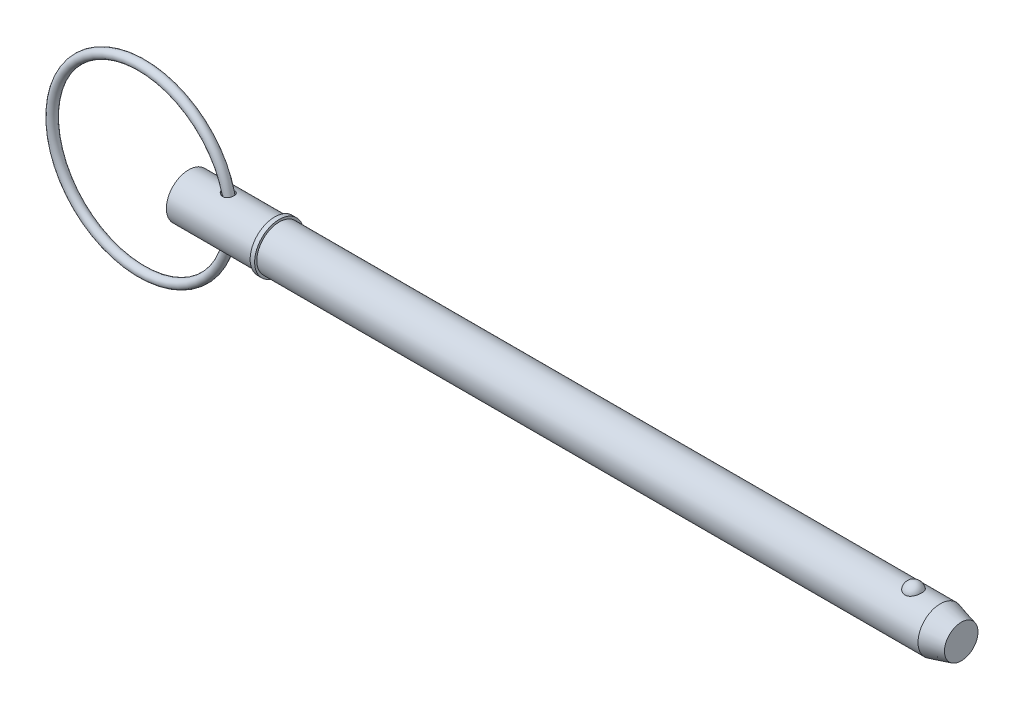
ISO-10303-21;
HEADER;
FILE_DESCRIPTION(('STEP AP214'),'2;1');
FILE_NAME('part.step','',(''),(''),'','','');
FILE_SCHEMA(('AUTOMOTIVE_DESIGN { 1 0 10303 214 1 1 1 1 }'));
ENDSEC;
DATA;
#1=APPLICATION_CONTEXT('core data for automotive mechanical design processes');
#2=APPLICATION_PROTOCOL_DEFINITION('international standard','automotive_design',2000,#1);
#3=PRODUCT_CONTEXT('',#1,'mechanical');
#4=PRODUCT('Part','Part','',(#3));
#5=PRODUCT_RELATED_PRODUCT_CATEGORY('part','',(#4));
#6=PRODUCT_DEFINITION_FORMATION('','',#4);
#7=PRODUCT_DEFINITION_CONTEXT('part definition',#1,'design');
#8=PRODUCT_DEFINITION('design','',#6,#7);
#9=PRODUCT_DEFINITION_SHAPE('','',#8);
#10=(LENGTH_UNIT() NAMED_UNIT(*) SI_UNIT(.MILLI.,.METRE.));
#11=(NAMED_UNIT(*) PLANE_ANGLE_UNIT() SI_UNIT($,.RADIAN.));
#12=(NAMED_UNIT(*) SI_UNIT($,.STERADIAN.) SOLID_ANGLE_UNIT());
#13=UNCERTAINTY_MEASURE_WITH_UNIT(LENGTH_MEASURE(1.E-05),#10,'distance_accuracy_value','');
#14=(GEOMETRIC_REPRESENTATION_CONTEXT(3) GLOBAL_UNCERTAINTY_ASSIGNED_CONTEXT((#13)) GLOBAL_UNIT_ASSIGNED_CONTEXT((#10,
#11,#12)) REPRESENTATION_CONTEXT('',''));
#15=CARTESIAN_POINT('',(0.,0.,0.));
#16=DIRECTION('',(0.,0.,1.));
#17=DIRECTION('',(1.,0.,0.));
#18=AXIS2_PLACEMENT_3D('',#15,#16,#17);
#19=CARTESIAN_POINT('',(-13.3798047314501,0.,0.));
#20=DIRECTION('',(0.,0.,1.));
#21=DIRECTION('',(1.,0.,0.));
#22=AXIS2_PLACEMENT_3D('',#19,#20,#21);
#23=TOROIDAL_SURFACE('',#22,25.4,1.27);
#24=CARTESIAN_POINT('',(13.2901952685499,0.,0.));
#25=VERTEX_POINT('',#24);
#26=VERTEX_LOOP('',#25);
#27=FACE_BOUND('',#26,.T.);
#28=ADVANCED_FACE('P0_F12',(#27),#23,.T.);
#29=CLOSED_SHELL('',(#28));
#30=MANIFOLD_SOLID_BREP('P0_B1',#29);
#31=CARTESIAN_POINT('',(0.,0.,0.));
#32=DIRECTION('',(1.,0.,0.));
#33=DIRECTION('',(0.,0.,-1.));
#34=AXIS2_PLACEMENT_3D('',#31,#32,#33);
#35=CYLINDRICAL_SURFACE('',#34,6.35);
#36=CARTESIAN_POINT('',(9.67500140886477,6.32698634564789,-0.540133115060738));
#37=CARTESIAN_POINT('',(9.70878953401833,6.3197498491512,-0.624879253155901));
#38=CARTESIAN_POINT('',(9.75028044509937,6.31105328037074,-0.706504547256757));
#39=CARTESIAN_POINT('',(9.84659255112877,6.29180070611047,-0.861319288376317));
#40=CARTESIAN_POINT('',(9.90144039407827,6.28124099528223,-0.934491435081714));
#41=CARTESIAN_POINT('',(10.021999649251,6.25949497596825,-1.0704877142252));
#42=CARTESIAN_POINT('',(10.0876589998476,6.2483118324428,-1.1333586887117));
#43=CARTESIAN_POINT('',(10.2280180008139,6.22641783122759,-1.24805262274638));
#44=CARTESIAN_POINT('',(10.3027159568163,6.21570688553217,-1.29987764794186));
#45=CARTESIAN_POINT('',(10.4650889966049,6.19509606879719,-1.39492899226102));
#46=CARTESIAN_POINT('',(10.5533142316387,6.1853135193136,-1.4372443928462));
#47=CARTESIAN_POINT('',(10.7357818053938,6.16871128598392,-1.50691441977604));
#48=CARTESIAN_POINT('',(10.8300253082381,6.16189217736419,-1.53426614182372));
#49=CARTESIAN_POINT('',(11.0227953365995,6.15211299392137,-1.57302798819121));
#50=CARTESIAN_POINT('',(11.1213511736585,6.14918579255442,-1.58430237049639));
#51=CARTESIAN_POINT('',(11.3189518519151,6.1478413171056,-1.58951619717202));
#52=CARTESIAN_POINT('',(11.417996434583,6.14942187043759,-1.58346399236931));
#53=CARTESIAN_POINT('',(11.6070859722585,6.15678569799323,-1.55457003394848));
#54=CARTESIAN_POINT('',(11.6973059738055,6.16229943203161,-1.53280404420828));
#55=CARTESIAN_POINT('',(11.8723373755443,6.176630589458,-1.4739892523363));
#56=CARTESIAN_POINT('',(11.9571502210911,6.185447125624,-1.43694455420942));
#57=CARTESIAN_POINT('',(12.1146737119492,6.20482821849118,-1.3507217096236));
#58=CARTESIAN_POINT('',(12.1877743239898,6.21528554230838,-1.30222952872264));
#59=CARTESIAN_POINT('',(12.324618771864,6.23705116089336,-1.19362916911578));
#60=CARTESIAN_POINT('',(12.3883628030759,6.24835943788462,-1.1335212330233));
#61=CARTESIAN_POINT('',(12.5046662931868,6.27053957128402,-1.00357204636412));
#62=CARTESIAN_POINT('',(12.5572571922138,6.28141258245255,-0.933759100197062));
#63=CARTESIAN_POINT('',(12.6502125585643,6.30157953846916,-0.786214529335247));
#64=CARTESIAN_POINT('',(12.6905764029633,6.31087340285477,-0.708482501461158));
#65=CARTESIAN_POINT('',(12.7585531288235,6.32699259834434,-0.546246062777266));
#66=CARTESIAN_POINT('',(12.7860022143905,6.33378599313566,-0.461669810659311));
#67=CARTESIAN_POINT('',(12.8267605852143,6.34401050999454,-0.288980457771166));
#68=CARTESIAN_POINT('',(12.8400695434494,6.34744155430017,-0.200867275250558));
#69=CARTESIAN_POINT('',(12.8522644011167,6.35058177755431,-0.0231943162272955));
#70=CARTESIAN_POINT('',(12.8510870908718,6.35027464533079,0.0663700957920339));
#71=CARTESIAN_POINT('',(12.8341831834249,6.34593169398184,0.244024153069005));
#72=CARTESIAN_POINT('',(12.8184563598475,6.341895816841,0.332113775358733));
#73=CARTESIAN_POINT('',(12.7728208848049,6.33052992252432,0.504322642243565));
#74=CARTESIAN_POINT('',(12.7429114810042,6.32319973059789,0.588441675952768));
#75=CARTESIAN_POINT('',(12.6696162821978,6.30604116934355,0.750316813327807));
#76=CARTESIAN_POINT('',(12.6262302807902,6.29621276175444,0.828072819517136));
#77=CARTESIAN_POINT('',(12.5270856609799,6.27515240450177,0.974918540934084));
#78=CARTESIAN_POINT('',(12.4713403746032,6.26392197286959,1.04401746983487));
#79=CARTESIAN_POINT('',(12.3488662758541,6.24131002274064,1.1716478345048));
#80=CARTESIAN_POINT('',(12.2821384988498,6.22992851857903,1.23018026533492));
#81=CARTESIAN_POINT('',(12.1401870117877,6.20841765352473,1.33449214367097));
#82=CARTESIAN_POINT('',(12.0650507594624,6.19827734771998,1.38038832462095));
#83=CARTESIAN_POINT('',(11.9079044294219,6.18026478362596,1.45892404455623));
#84=CARTESIAN_POINT('',(11.8258951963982,6.17239224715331,1.49156520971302));
#85=CARTESIAN_POINT('',(11.6581736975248,6.15982613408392,1.54263810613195));
#86=CARTESIAN_POINT('',(11.572502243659,6.15510409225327,1.56119728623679));
#87=CARTESIAN_POINT('',(11.3991899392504,6.14916283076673,1.58443707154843));
#88=CARTESIAN_POINT('',(11.3115488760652,6.14794399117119,1.58911617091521));
#89=CARTESIAN_POINT('',(11.1345547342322,6.14904466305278,1.58485137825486));
#90=CARTESIAN_POINT('',(11.0452104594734,6.15144894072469,1.5755811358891));
#91=CARTESIAN_POINT('',(10.8691479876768,6.15957601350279,1.54349959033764));
#92=CARTESIAN_POINT('',(10.782430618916,6.16529984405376,1.52068406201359));
#93=CARTESIAN_POINT('',(10.6082848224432,6.17983892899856,1.4605156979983));
#94=CARTESIAN_POINT('',(10.5211557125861,6.1888262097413,1.42233764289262));
#95=CARTESIAN_POINT('',(10.3542377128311,6.20874782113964,1.33268652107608));
#96=CARTESIAN_POINT('',(10.2744521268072,6.21968302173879,1.28120750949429));
#97=CARTESIAN_POINT('',(10.120854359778,6.24282707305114,1.16334748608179));
#98=CARTESIAN_POINT('',(10.0474902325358,6.25507146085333,1.09638652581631));
#99=CARTESIAN_POINT('',(9.91368693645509,6.27890019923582,0.950453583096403));
#100=CARTESIAN_POINT('',(9.85324511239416,6.29048468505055,0.87148407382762));
#101=CARTESIAN_POINT('',(9.75037543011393,6.31102161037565,0.707140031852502));
#102=CARTESIAN_POINT('',(9.70726585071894,6.32006820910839,0.622206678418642));
#103=CARTESIAN_POINT('',(9.63775895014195,6.33497125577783,0.445490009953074));
#104=CARTESIAN_POINT('',(9.61134627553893,6.34083063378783,0.35371307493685));
#105=CARTESIAN_POINT('',(9.57891955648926,6.34807071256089,0.177220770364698));
#106=CARTESIAN_POINT('',(9.5709352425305,6.3498832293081,0.0928817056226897));
#107=CARTESIAN_POINT('',(9.56994851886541,6.35010532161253,-0.0758268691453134));
#108=CARTESIAN_POINT('',(9.57692695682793,6.34851924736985,-0.160196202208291));
#109=CARTESIAN_POINT('',(9.59985709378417,6.34339435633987,-0.294043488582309));
#110=CARTESIAN_POINT('',(9.61128951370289,6.34084912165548,-0.34438537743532));
#111=CARTESIAN_POINT('',(9.63933183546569,6.33468615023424,-0.443526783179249));
#112=CARTESIAN_POINT('',(9.65594100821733,6.33106856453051,-0.492326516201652));
#113=CARTESIAN_POINT('',(9.67500140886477,6.32698634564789,-0.540133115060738));
#114=B_SPLINE_CURVE_WITH_KNOTS('',3,(#36,#37,#38,#39,#40,#41,#42,#43,#44,#45,#46,#47,#48,#49,
#50,#51,#52,#53,#54,#55,#56,#57,#58,#59,#60,#61,#62,#63,#64,#65,#66,#67,#68,#69,#70,#71,#72,#73,
#74,#75,#76,#77,#78,#79,#80,#81,#82,#83,#84,#85,#86,#87,#88,#89,#90,#91,#92,#93,#94,#95,#96,#97,
#98,#99,#100,#101,#102,#103,#104,#105,#106,#107,#108,#109,#110,#111,#112,#113),.UNSPECIFIED.,
.T.,.F.,(4,2,2,2,2,2,2,2,2,2,2,2,2,2,2,2,2,2,2,2,2,2,2,2,2,2,2,2,2,2,2,2,2,2,2,2,2,2,4),(0.,
0.274348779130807,0.54924945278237,0.822863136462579,1.09642560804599,1.3900770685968,
1.68378550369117,1.97995934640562,2.27599046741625,2.55347281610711,2.83088067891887,
3.09465189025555,3.35841759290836,3.62142956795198,3.88445494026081,4.1507318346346,
4.4170148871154,4.68446025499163,4.95190978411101,5.21937350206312,5.48684131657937,
5.75402200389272,6.02117751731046,6.28577524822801,6.55034050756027,6.81248178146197,
7.0746514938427,7.34305086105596,7.61153399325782,7.89692981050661,8.18245340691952,
8.48120635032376,8.77989784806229,9.06530254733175,9.35044442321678,9.60331609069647,
9.85586427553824,10.010650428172,10.1654147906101),.UNSPECIFIED.);
#115=CARTESIAN_POINT('',(9.67500140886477,6.32698634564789,-0.540133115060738));
#116=VERTEX_POINT('',#115);
#117=EDGE_CURVE('P1_E42',#116,#116,#114,.T.);
#118=ORIENTED_EDGE('',*,*,#117,.T.);
#119=EDGE_LOOP('',(#118));
#120=FACE_BOUND('',#119,.T.);
#121=CARTESIAN_POINT('',(0.,0.,0.));
#122=DIRECTION('',(1.,0.,0.));
#123=DIRECTION('',(0.,0.,-1.));
#124=AXIS2_PLACEMENT_3D('',#121,#122,#123);
#125=CIRCLE('',#124,6.35);
#126=CARTESIAN_POINT('',(0.,0.,-6.35));
#127=VERTEX_POINT('',#126);
#128=EDGE_CURVE('P1_E9',#127,#127,#125,.T.);
#129=ORIENTED_EDGE('',*,*,#128,.T.);
#130=EDGE_LOOP('',(#129));
#131=FACE_BOUND('',#130,.T.);
#132=CARTESIAN_POINT('',(24.43,0.,0.));
#133=DIRECTION('',(1.,0.,0.));
#134=DIRECTION('',(0.,0.,-1.));
#135=AXIS2_PLACEMENT_3D('',#132,#133,#134);
#136=CIRCLE('',#135,6.35);
#137=CARTESIAN_POINT('',(24.43,0.,-6.35));
#138=VERTEX_POINT('',#137);
#139=EDGE_CURVE('P1_E25',#138,#138,#136,.T.);
#140=ORIENTED_EDGE('',*,*,#139,.F.);
#141=EDGE_LOOP('',(#140));
#142=FACE_BOUND('',#141,.T.);
#143=CARTESIAN_POINT('',(9.67500140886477,-6.32698634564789,-0.540133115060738));
#144=CARTESIAN_POINT('',(9.64544894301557,-6.33331515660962,-0.46600258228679));
#145=CARTESIAN_POINT('',(9.62177180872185,-6.33852974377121,-0.389437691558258));
#146=CARTESIAN_POINT('',(9.58727043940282,-6.34619174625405,-0.233330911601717));
#147=CARTESIAN_POINT('',(9.57644043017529,-6.34864040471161,-0.153790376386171));
#148=CARTESIAN_POINT('',(9.56819517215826,-6.3505010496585,0.00612071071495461));
#149=CARTESIAN_POINT('',(9.57079639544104,-6.34990930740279,0.0864921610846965));
#150=CARTESIAN_POINT('',(9.58930797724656,-6.3457478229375,0.245607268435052));
#151=CARTESIAN_POINT('',(9.60522046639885,-6.34217760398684,0.324350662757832));
#152=CARTESIAN_POINT('',(9.64931570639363,-6.3324977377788,0.47727605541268));
#153=CARTESIAN_POINT('',(9.67737525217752,-6.32641361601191,0.551495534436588));
#154=CARTESIAN_POINT('',(9.74451510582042,-6.31231128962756,0.69455132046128));
#155=CARTESIAN_POINT('',(9.78359827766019,-6.30429258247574,0.763386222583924));
#156=CARTESIAN_POINT('',(9.87474700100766,-6.28638332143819,0.899414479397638));
#157=CARTESIAN_POINT('',(9.92757481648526,-6.27639669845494,0.966083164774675));
#158=CARTESIAN_POINT('',(10.042675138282,-6.25596164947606,1.09061181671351));
#159=CARTESIAN_POINT('',(10.1049521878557,-6.24551300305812,1.14846751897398));
#160=CARTESIAN_POINT('',(10.2445505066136,-6.22397505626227,1.26024641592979));
#161=CARTESIAN_POINT('',(10.3227711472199,-6.2129394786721,1.31305951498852));
#162=CARTESIAN_POINT('',(10.4867924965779,-6.19263757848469,1.40570084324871));
#163=CARTESIAN_POINT('',(10.5725962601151,-6.18337197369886,1.44552380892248));
#164=CARTESIAN_POINT('',(10.7543302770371,-6.16725983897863,1.51283687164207));
#165=CARTESIAN_POINT('',(10.8505554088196,-6.16056505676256,1.53957358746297));
#166=CARTESIAN_POINT('',(11.0463546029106,-6.15127671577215,1.57628137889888));
#167=CARTESIAN_POINT('',(11.1459276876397,-6.14868197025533,1.58625730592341));
#168=CARTESIAN_POINT('',(11.3414257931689,-6.14810798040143,1.58848000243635));
#169=CARTESIAN_POINT('',(11.4373417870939,-6.14995283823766,1.58140242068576));
#170=CARTESIAN_POINT('',(11.6262783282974,-6.1577972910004,1.55057566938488));
#171=CARTESIAN_POINT('',(11.719300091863,-6.16379511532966,1.52683360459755));
#172=CARTESIAN_POINT('',(11.8934223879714,-6.17873566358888,1.46514575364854));
#173=CARTESIAN_POINT('',(11.9749048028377,-6.18746207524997,1.42822144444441));
#174=CARTESIAN_POINT('',(12.1301362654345,-6.20693584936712,1.34105645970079));
#175=CARTESIAN_POINT('',(12.2038861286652,-6.21768299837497,1.29081719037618));
#176=CARTESIAN_POINT('',(12.3399792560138,-6.23970077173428,1.17972764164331));
#177=CARTESIAN_POINT('',(12.4025430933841,-6.25095401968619,1.11914355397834));
#178=CARTESIAN_POINT('',(12.5166805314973,-6.27296916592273,0.988307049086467));
#179=CARTESIAN_POINT('',(12.568253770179,-6.28373104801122,0.918054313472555));
#180=CARTESIAN_POINT('',(12.6596230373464,-6.3037060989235,0.769081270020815));
#181=CARTESIAN_POINT('',(12.6992956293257,-6.31290263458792,0.690283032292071));
#182=CARTESIAN_POINT('',(12.7652258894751,-6.32862394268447,0.527011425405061));
#183=CARTESIAN_POINT('',(12.7914829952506,-6.33514860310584,0.442537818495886));
#184=CARTESIAN_POINT('',(12.8301436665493,-6.34487485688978,0.269505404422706));
#185=CARTESIAN_POINT('',(12.8424230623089,-6.34804664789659,0.180917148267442));
#186=CARTESIAN_POINT('',(12.8524214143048,-6.35062347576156,0.00286829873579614));
#187=CARTESIAN_POINT('',(12.8501402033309,-6.35002846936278,-0.0865923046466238));
#188=CARTESIAN_POINT('',(12.8310619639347,-6.34513332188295,-0.263931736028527));
#189=CARTESIAN_POINT('',(12.8142517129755,-6.34082980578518,-0.35180904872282));
#190=CARTESIAN_POINT('',(12.7664911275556,-6.32897674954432,-0.523406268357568));
#191=CARTESIAN_POINT('',(12.7355404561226,-6.3214271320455,-0.607126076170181));
#192=CARTESIAN_POINT('',(12.6602298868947,-6.30390232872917,-0.768030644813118));
#193=CARTESIAN_POINT('',(12.6158695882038,-6.29392707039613,-0.845215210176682));
#194=CARTESIAN_POINT('',(12.5148171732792,-6.2726521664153,-0.990836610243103));
#195=CARTESIAN_POINT('',(12.4581254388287,-6.26135256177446,-1.05927371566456));
#196=CARTESIAN_POINT('',(12.33416419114,-6.2387572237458,-1.18510935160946));
#197=CARTESIAN_POINT('',(12.2669484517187,-6.22746174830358,-1.24256086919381));
#198=CARTESIAN_POINT('',(12.1235592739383,-6.20610255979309,-1.34519464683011));
#199=CARTESIAN_POINT('',(12.0473871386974,-6.19603866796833,-1.39037868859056));
#200=CARTESIAN_POINT('',(11.8892714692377,-6.17839642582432,-1.46678006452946));
#201=CARTESIAN_POINT('',(11.8074126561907,-6.17078838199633,-1.49816605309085));
#202=CARTESIAN_POINT('',(11.6394563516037,-6.15869606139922,-1.54712759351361));
#203=CARTESIAN_POINT('',(11.5533589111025,-6.15421174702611,-1.56470331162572));
#204=CARTESIAN_POINT('',(11.3789660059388,-6.14876652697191,-1.58596734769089));
#205=CARTESIAN_POINT('',(11.2906621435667,-6.1478222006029,-1.58959032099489));
#206=CARTESIAN_POINT('',(11.1146029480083,-6.149490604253,-1.58312110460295));
#207=CARTESIAN_POINT('',(11.0268477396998,-6.1521041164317,-1.57302589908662));
#208=CARTESIAN_POINT('',(10.8498668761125,-6.16071031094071,-1.53898332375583));
#209=CARTESIAN_POINT('',(10.7607726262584,-6.16685908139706,-1.51439468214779));
#210=CARTESIAN_POINT('',(10.5876521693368,-6.18189031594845,-1.45181305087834));
#211=CARTESIAN_POINT('',(10.5036282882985,-6.19077402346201,-1.41381396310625));
#212=CARTESIAN_POINT('',(10.3374228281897,-6.2109378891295,-1.32252480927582));
#213=CARTESIAN_POINT('',(10.255708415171,-6.2223355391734,-1.26840756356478));
#214=CARTESIAN_POINT('',(10.1025645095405,-6.24580740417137,-1.14725208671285));
#215=CARTESIAN_POINT('',(10.0311354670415,-6.25788164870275,-1.08021329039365));
#216=CARTESIAN_POINT('',(9.90472699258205,-6.2806176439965,-0.938710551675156));
#217=CARTESIAN_POINT('',(9.84904456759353,-6.29132066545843,-0.864883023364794));
#218=CARTESIAN_POINT('',(9.75129345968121,-6.31084098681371,-0.708496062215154));
#219=CARTESIAN_POINT('',(9.70921094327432,-6.31966019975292,-0.625945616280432));
#220=CARTESIAN_POINT('',(9.67500140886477,-6.32698634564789,-0.540133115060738));
#221=B_SPLINE_CURVE_WITH_KNOTS('',3,(#143,#144,#145,#146,#147,#148,#149,#150,#151,#152,#153,
#154,#155,#156,#157,#158,#159,#160,#161,#162,#163,#164,#165,#166,#167,#168,#169,#170,#171,#172,
#173,#174,#175,#176,#177,#178,#179,#180,#181,#182,#183,#184,#185,#186,#187,#188,#189,#190,#191,
#192,#193,#194,#195,#196,#197,#198,#199,#200,#201,#202,#203,#204,#205,#206,#207,#208,#209,#210,
#211,#212,#213,#214,#215,#216,#217,#218,#219,#220),.UNSPECIFIED.,.T.,.F.,(4,2,2,2,2,2,2,2,2,2,2,
2,2,2,2,2,2,2,2,2,2,2,2,2,2,2,2,2,2,2,2,2,2,2,2,2,2,2,4),(0.,0.239871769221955,
0.479635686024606,0.719693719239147,0.959790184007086,1.19750645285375,1.43528453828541,
1.69117930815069,1.94719750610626,2.23102979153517,2.51497694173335,2.81376497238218,
3.11246650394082,3.39952951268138,3.68647020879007,3.95479420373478,4.22308987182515,
4.48530700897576,4.74753278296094,5.01239119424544,5.27726070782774,5.54446524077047,
5.81167284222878,6.07912387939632,6.34658129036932,6.61404669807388,6.88150382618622,
7.1476364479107,7.41373039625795,7.67647472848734,7.93921589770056,8.20318607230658,
8.46721428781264,8.74390821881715,9.02072813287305,9.31537622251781,9.61003720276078,
9.88799314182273,10.1656654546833),.UNSPECIFIED.);
#222=CARTESIAN_POINT('',(9.67500140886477,-6.32698634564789,-0.540133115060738));
#223=VERTEX_POINT('',#222);
#224=EDGE_CURVE('P1_E17',#223,#223,#221,.T.);
#225=ORIENTED_EDGE('',*,*,#224,.T.);
#226=EDGE_LOOP('',(#225));
#227=FACE_BOUND('',#226,.T.);
#228=ADVANCED_FACE('P1_F13',(#120,#131,#142,#227),#35,.T.);
#229=CARTESIAN_POINT('',(0.,0.,0.));
#230=DIRECTION('',(1.,0.,0.));
#231=DIRECTION('',(0.,0.,-1.));
#232=AXIS2_PLACEMENT_3D('',#229,#230,#231);
#233=CYLINDRICAL_SURFACE('',#232,6.35);
#234=CARTESIAN_POINT('',(213.455369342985,0.,0.));
#235=DIRECTION('',(1.,0.,0.));
#236=DIRECTION('',(0.,0.,-1.));
#237=AXIS2_PLACEMENT_3D('',#234,#235,#236);
#238=CIRCLE('',#237,6.35);
#239=CARTESIAN_POINT('',(213.455369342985,0.,-6.35));
#240=VERTEX_POINT('',#239);
#241=EDGE_CURVE('P1_E99',#240,#240,#238,.T.);
#242=ORIENTED_EDGE('',*,*,#241,.F.);
#243=EDGE_LOOP('',(#242));
#244=FACE_BOUND('',#243,.T.);
#245=CARTESIAN_POINT('',(25.7,0.,0.));
#246=DIRECTION('',(1.,0.,0.));
#247=DIRECTION('',(0.,0.,-1.));
#248=AXIS2_PLACEMENT_3D('',#245,#246,#247);
#249=CIRCLE('',#248,6.35);
#250=CARTESIAN_POINT('',(25.7,0.,-6.35));
#251=VERTEX_POINT('',#250);
#252=EDGE_CURVE('P1_E96',#251,#251,#249,.T.);
#253=ORIENTED_EDGE('',*,*,#252,.T.);
#254=EDGE_LOOP('',(#253));
#255=FACE_BOUND('',#254,.T.);
#256=CARTESIAN_POINT('',(205.830021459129,5.87502187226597,2.40969251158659));
#257=CARTESIAN_POINT('',(205.705030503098,5.87501645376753,2.40969773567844));
#258=CARTESIAN_POINT('',(205.580080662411,5.87916061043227,2.39967292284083));
#259=CARTESIAN_POINT('',(205.333909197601,5.8952311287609,2.35991730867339));
#260=CARTESIAN_POINT('',(205.212686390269,5.90715499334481,2.33019283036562));
#261=CARTESIAN_POINT('',(204.977517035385,5.93739567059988,2.25201402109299));
#262=CARTESIAN_POINT('',(204.863560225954,5.95570321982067,2.20358681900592));
#263=CARTESIAN_POINT('',(204.64557352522,5.9967206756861,2.089379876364));
#264=CARTESIAN_POINT('',(204.541545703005,6.01943149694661,2.02359652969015));
#265=CARTESIAN_POINT('',(204.342943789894,6.06760647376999,1.87428969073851));
#266=CARTESIAN_POINT('',(204.248726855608,6.09313095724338,1.79031110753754));
#267=CARTESIAN_POINT('',(204.075255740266,6.14375873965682,1.60800178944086));
#268=CARTESIAN_POINT('',(203.996004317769,6.16886196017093,1.50966841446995));
#269=CARTESIAN_POINT('',(203.850845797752,6.21724600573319,1.29645884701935));
#270=CARTESIAN_POINT('',(203.785688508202,6.24039621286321,1.18104158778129));
#271=CARTESIAN_POINT('',(203.674703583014,6.28117277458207,0.940351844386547));
#272=CARTESIAN_POINT('',(203.628877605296,6.29879865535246,0.815078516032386));
#273=CARTESIAN_POINT('',(203.557023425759,6.32692073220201,0.556494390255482));
#274=CARTESIAN_POINT('',(203.531249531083,6.33732517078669,0.423102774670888));
#275=CARTESIAN_POINT('',(203.500988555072,6.34957673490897,0.153542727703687));
#276=CARTESIAN_POINT('',(203.496500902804,6.35142408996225,0.0173743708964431));
#277=CARTESIAN_POINT('',(203.508865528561,6.34638925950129,-0.253036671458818));
#278=CARTESIAN_POINT('',(203.525594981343,6.33955731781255,-0.387285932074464));
#279=CARTESIAN_POINT('',(203.579843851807,6.31794129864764,-0.650851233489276));
#280=CARTESIAN_POINT('',(203.617363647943,6.30315707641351,-0.780167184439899));
#281=CARTESIAN_POINT('',(203.712500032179,6.26711642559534,-1.03041949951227));
#282=CARTESIAN_POINT('',(203.770143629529,6.24585130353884,-1.1513443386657));
#283=CARTESIAN_POINT('',(203.904352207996,6.19905619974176,-1.38129800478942));
#284=CARTESIAN_POINT('',(203.980918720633,6.17352587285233,-1.49032586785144));
#285=CARTESIAN_POINT('',(204.151753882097,6.12080227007,-1.69393164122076));
#286=CARTESIAN_POINT('',(204.246100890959,6.09360200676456,-1.78844209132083));
#287=CARTESIAN_POINT('',(204.450119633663,6.04070434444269,-1.95970536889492));
#288=CARTESIAN_POINT('',(204.559790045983,6.01500681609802,-2.03645972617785));
#289=CARTESIAN_POINT('',(204.789187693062,5.96867714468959,-2.16845644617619));
#290=CARTESIAN_POINT('',(204.908652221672,5.94794910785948,-2.22412062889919));
#291=CARTESIAN_POINT('',(205.156218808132,5.91340580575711,-2.31440992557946));
#292=CARTESIAN_POINT('',(205.284317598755,5.8995879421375,-2.3490429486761));
#293=CARTESIAN_POINT('',(205.538582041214,5.88111049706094,-2.39491590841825));
#294=CARTESIAN_POINT('',(205.664520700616,5.876025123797,-2.40724512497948));
#295=CARTESIAN_POINT('',(205.916786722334,5.87428980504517,-2.41147867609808));
#296=CARTESIAN_POINT('',(206.043114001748,5.87763817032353,-2.40338710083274));
#297=CARTESIAN_POINT('',(206.288417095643,5.89212921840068,-2.367627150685));
#298=CARTESIAN_POINT('',(206.407499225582,5.90302431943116,-2.34058030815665));
#299=CARTESIAN_POINT('',(206.63924472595,5.93113752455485,-2.26839066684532));
#300=CARTESIAN_POINT('',(206.751907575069,5.94835614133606,-2.22324640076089));
#301=CARTESIAN_POINT('',(206.970400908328,5.98773016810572,-2.11493806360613));
#302=CARTESIAN_POINT('',(207.076028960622,6.00998499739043,-2.05140269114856));
#303=CARTESIAN_POINT('',(207.275300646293,6.05690144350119,-1.90842705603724));
#304=CARTESIAN_POINT('',(207.368941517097,6.08156361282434,-1.82898313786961));
#305=CARTESIAN_POINT('',(207.546675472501,6.13211715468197,-1.65182429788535));
#306=CARTESIAN_POINT('',(207.630055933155,6.15800825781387,-1.55339381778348));
#307=CARTESIAN_POINT('',(207.779790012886,6.20712834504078,-1.34374214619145));
#308=CARTESIAN_POINT('',(207.846140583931,6.23035685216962,-1.23251867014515));
#309=CARTESIAN_POINT('',(207.962345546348,6.27251177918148,-0.996447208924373));
#310=CARTESIAN_POINT('',(208.011607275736,6.29127762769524,-0.871278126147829));
#311=CARTESIAN_POINT('',(208.089614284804,6.3215862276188,-0.613870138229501));
#312=CARTESIAN_POINT('',(208.118359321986,6.33312889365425,-0.481631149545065));
#313=CARTESIAN_POINT('',(208.15477058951,6.34782349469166,-0.213672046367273));
#314=CARTESIAN_POINT('',(208.162413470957,6.35096613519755,-0.0779482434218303));
#315=CARTESIAN_POINT('',(208.156395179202,6.34851322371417,0.192943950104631));
#316=CARTESIAN_POINT('',(208.142734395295,6.3429178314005,0.328112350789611));
#317=CARTESIAN_POINT('',(208.09450361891,6.32360512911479,0.593406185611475));
#318=CARTESIAN_POINT('',(208.060031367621,6.30992579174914,0.723552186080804));
#319=CARTESIAN_POINT('',(207.970953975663,6.27586325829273,0.97583417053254));
#320=CARTESIAN_POINT('',(207.91634761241,6.25547965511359,1.09796966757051));
#321=CARTESIAN_POINT('',(207.78775879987,6.20998183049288,1.33148921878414));
#322=CARTESIAN_POINT('',(207.713674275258,6.18484288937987,1.44281227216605));
#323=CARTESIAN_POINT('',(207.547820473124,6.13258735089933,1.65087683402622));
#324=CARTESIAN_POINT('',(207.456051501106,6.10547078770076,1.74761859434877));
#325=CARTESIAN_POINT('',(207.257183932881,6.05235879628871,1.92350926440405));
#326=CARTESIAN_POINT('',(207.150133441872,6.0263601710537,2.00271146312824));
#327=CARTESIAN_POINT('',(206.923138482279,5.97843747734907,2.1415415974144));
#328=CARTESIAN_POINT('',(206.803191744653,5.95651412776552,2.20116608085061));
#329=CARTESIAN_POINT('',(206.544523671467,5.91812106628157,2.30250570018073));
#330=CARTESIAN_POINT('',(206.40506980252,5.90217533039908,2.34256795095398));
#331=CARTESIAN_POINT('',(206.120397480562,5.88063128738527,2.39615214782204));
#332=CARTESIAN_POINT('',(205.97518174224,5.8750281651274,2.40968644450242));
#333=CARTESIAN_POINT('',(205.830021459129,5.87502187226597,2.40969251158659));
#334=B_SPLINE_CURVE_WITH_KNOTS('',3,(#256,#257,#258,#259,#260,#261,#262,#263,#264,#265,#266,
#267,#268,#269,#270,#271,#272,#273,#274,#275,#276,#277,#278,#279,#280,#281,#282,#283,#284,#285,
#286,#287,#288,#289,#290,#291,#292,#293,#294,#295,#296,#297,#298,#299,#300,#301,#302,#303,#304,
#305,#306,#307,#308,#309,#310,#311,#312,#313,#314,#315,#316,#317,#318,#319,#320,#321,#322,#323,
#324,#325,#326,#327,#328,#329,#330,#331,#332,#333),.UNSPECIFIED.,.T.,.F.,(4,2,2,2,2,2,2,2,2,2,2,
2,2,2,2,2,2,2,2,2,2,2,2,2,2,2,2,2,2,2,2,2,2,2,2,2,2,2,4),(0.,0.374440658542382,
0.748761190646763,1.1225407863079,1.49639810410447,1.88098871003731,2.2656501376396,
2.66741104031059,3.06920639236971,3.47601794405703,3.88281858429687,4.28727498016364,
4.69173873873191,5.09674745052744,5.50178895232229,5.9086591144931,6.31549420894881,
6.71369855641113,7.11175305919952,7.48978077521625,7.86773278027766,8.23383886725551,
8.59997464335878,8.97409044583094,9.34829231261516,9.74122667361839,10.1342313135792,
10.5397522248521,10.9452779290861,11.3512521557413,11.7572189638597,12.1612938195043,
12.5653932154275,12.9716540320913,13.3779078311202,13.7829098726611,14.1879832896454,
14.6230486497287,15.0579114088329),.UNSPECIFIED.);
#335=CARTESIAN_POINT('',(205.830021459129,5.87502187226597,2.40969251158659));
#336=VERTEX_POINT('',#335);
#337=EDGE_CURVE('P1_E34',#336,#336,#334,.T.);
#338=ORIENTED_EDGE('',*,*,#337,.T.);
#339=EDGE_LOOP('',(#338));
#340=FACE_BOUND('',#339,.T.);
#341=ADVANCED_FACE('P1_F46',(#244,#255,#340),#233,.T.);
#342=CARTESIAN_POINT('',(0.,0.,0.));
#343=DIRECTION('',(-1.,0.,0.));
#344=DIRECTION('',(0.,0.,1.));
#345=AXIS2_PLACEMENT_3D('',#342,#343,#344);
#346=PLANE('',#345);
#347=ORIENTED_EDGE('',*,*,#128,.F.);
#348=EDGE_LOOP('',(#347));
#349=FACE_BOUND('',#348,.T.);
#350=ADVANCED_FACE('P1_F15',(#349),#346,.T.);
#351=CARTESIAN_POINT('',(24.43,6.35,0.));
#352=DIRECTION('',(-1.,0.,0.));
#353=DIRECTION('',(0.,0.,1.));
#354=AXIS2_PLACEMENT_3D('',#351,#352,#353);
#355=PLANE('',#354);
#356=ORIENTED_EDGE('',*,*,#139,.T.);
#357=EDGE_LOOP('',(#356));
#358=FACE_BOUND('',#357,.T.);
#359=CARTESIAN_POINT('',(24.43,0.,0.));
#360=DIRECTION('',(1.,0.,0.));
#361=DIRECTION('',(0.,0.,-1.));
#362=AXIS2_PLACEMENT_3D('',#359,#360,#361);
#363=CIRCLE('',#362,6.985);
#364=CARTESIAN_POINT('',(24.43,0.,-6.985));
#365=VERTEX_POINT('',#364);
#366=EDGE_CURVE('P1_E30',#365,#365,#363,.T.);
#367=ORIENTED_EDGE('',*,*,#366,.F.);
#368=EDGE_LOOP('',(#367));
#369=FACE_BOUND('',#368,.T.);
#370=ADVANCED_FACE('P1_F81',(#358,#369),#355,.T.);
#371=CARTESIAN_POINT('',(0.,0.,0.));
#372=DIRECTION('',(1.,0.,0.));
#373=DIRECTION('',(0.,0.,-1.));
#374=AXIS2_PLACEMENT_3D('',#371,#372,#373);
#375=CYLINDRICAL_SURFACE('',#374,6.985);
#376=ORIENTED_EDGE('',*,*,#366,.T.);
#377=EDGE_LOOP('',(#376));
#378=FACE_BOUND('',#377,.T.);
#379=CARTESIAN_POINT('',(25.7,0.,0.));
#380=DIRECTION('',(1.,0.,0.));
#381=DIRECTION('',(0.,0.,-1.));
#382=AXIS2_PLACEMENT_3D('',#379,#380,#381);
#383=CIRCLE('',#382,6.985);
#384=CARTESIAN_POINT('',(25.7,0.,-6.985));
#385=VERTEX_POINT('',#384);
#386=EDGE_CURVE('P1_E95',#385,#385,#383,.T.);
#387=ORIENTED_EDGE('',*,*,#386,.F.);
#388=EDGE_LOOP('',(#387));
#389=FACE_BOUND('',#388,.T.);
#390=ADVANCED_FACE('P1_F68',(#378,#389),#375,.T.);
#391=CARTESIAN_POINT('',(25.7,6.985,0.));
#392=DIRECTION('',(1.,0.,0.));
#393=DIRECTION('',(0.,0.,-1.));
#394=AXIS2_PLACEMENT_3D('',#391,#392,#393);
#395=PLANE('',#394);
#396=ORIENTED_EDGE('',*,*,#386,.T.);
#397=EDGE_LOOP('',(#396));
#398=FACE_BOUND('',#397,.T.);
#399=ORIENTED_EDGE('',*,*,#252,.F.);
#400=EDGE_LOOP('',(#399));
#401=FACE_BOUND('',#400,.T.);
#402=ADVANCED_FACE('P1_F62',(#398,#401),#395,.T.);
#403=CARTESIAN_POINT('',(219.38,0.,0.));
#404=DIRECTION('',(-1.,0.,0.));
#405=DIRECTION('',(0.,0.,1.));
#406=AXIS2_PLACEMENT_3D('',#403,#404,#405);
#407=CONICAL_SURFACE('',#406,4.76250000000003,0.261799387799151);
#408=ORIENTED_EDGE('',*,*,#241,.T.);
#409=EDGE_LOOP('',(#408));
#410=FACE_BOUND('',#409,.T.);
#411=CARTESIAN_POINT('',(219.38,0.,0.));
#412=DIRECTION('',(1.,0.,0.));
#413=DIRECTION('',(0.,0.,-1.));
#414=AXIS2_PLACEMENT_3D('',#411,#412,#413);
#415=CIRCLE('',#414,4.76250000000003);
#416=CARTESIAN_POINT('',(219.38,0.,-4.76250000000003));
#417=VERTEX_POINT('',#416);
#418=EDGE_CURVE('P1_E41',#417,#417,#415,.T.);
#419=ORIENTED_EDGE('',*,*,#418,.F.);
#420=EDGE_LOOP('',(#419));
#421=FACE_BOUND('',#420,.T.);
#422=ADVANCED_FACE('P1_F59',(#410,#421),#407,.T.);
#423=CARTESIAN_POINT('',(219.38,4.76250000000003,0.));
#424=DIRECTION('',(1.,0.,0.));
#425=DIRECTION('',(0.,0.,-1.));
#426=AXIS2_PLACEMENT_3D('',#423,#424,#425);
#427=PLANE('',#426);
#428=ORIENTED_EDGE('',*,*,#418,.T.);
#429=EDGE_LOOP('',(#428));
#430=FACE_BOUND('',#429,.T.);
#431=ADVANCED_FACE('P1_F55',(#430),#427,.T.);
#432=CARTESIAN_POINT('',(205.830021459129,5.71499999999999,0.));
#433=DIRECTION('',(-1.,0.,0.));
#434=DIRECTION('',(0.,1.,0.));
#435=AXIS2_PLACEMENT_3D('',#432,#433,#434);
#436=SPHERICAL_SURFACE('',#435,2.415);
#437=ORIENTED_EDGE('',*,*,#337,.F.);
#438=EDGE_LOOP('',(#437));
#439=FACE_BOUND('',#438,.T.);
#440=ADVANCED_FACE('P1_F50',(#439),#436,.T.);
#441=CARTESIAN_POINT('',(-13.3798047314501,0.,0.));
#442=DIRECTION('',(0.,0.,1.));
#443=DIRECTION('',(1.,0.,0.));
#444=AXIS2_PLACEMENT_3D('',#441,#442,#443);
#445=TOROIDAL_SURFACE('',#444,25.4,1.5875);
#446=ORIENTED_EDGE('',*,*,#224,.F.);
#447=EDGE_LOOP('',(#446));
#448=FACE_BOUND('',#447,.T.);
#449=ORIENTED_EDGE('',*,*,#117,.F.);
#450=EDGE_LOOP('',(#449));
#451=FACE_BOUND('',#450,.T.);
#452=ADVANCED_FACE('P1_F54',(#448,#451),#445,.F.);
#453=CLOSED_SHELL('',(#228,#341,#350,#370,#390,#402,#422,#431,#440,#452));
#454=MANIFOLD_SOLID_BREP('P1_B1',#453);
#455=ADVANCED_BREP_SHAPE_REPRESENTATION('',(#18,#30,#454),#14);
#456=SHAPE_DEFINITION_REPRESENTATION(#9,#455);
ENDSEC;
END-ISO-10303-21;
